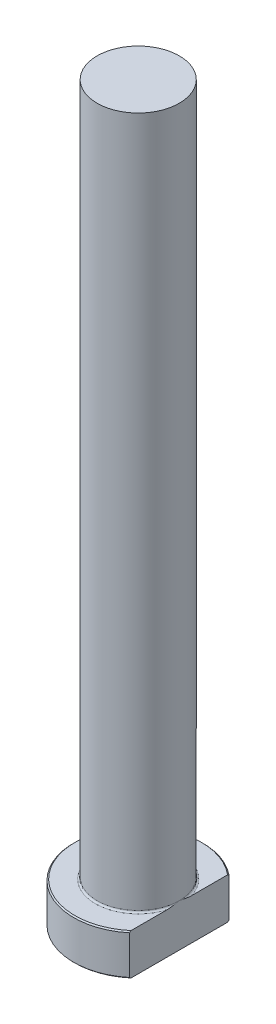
ISO-10303-21;
HEADER;
FILE_DESCRIPTION(('STEP AP214'),'2;1');
FILE_NAME('part.step','',(''),(''),'','','');
FILE_SCHEMA(('AUTOMOTIVE_DESIGN { 1 0 10303 214 1 1 1 1 }'));
ENDSEC;
DATA;
#1=APPLICATION_CONTEXT('core data for automotive mechanical design processes');
#2=APPLICATION_PROTOCOL_DEFINITION('international standard','automotive_design',2000,#1);
#3=PRODUCT_CONTEXT('',#1,'mechanical');
#4=PRODUCT('Part','Part','',(#3));
#5=PRODUCT_RELATED_PRODUCT_CATEGORY('part','',(#4));
#6=PRODUCT_DEFINITION_FORMATION('','',#4);
#7=PRODUCT_DEFINITION_CONTEXT('part definition',#1,'design');
#8=PRODUCT_DEFINITION('design','',#6,#7);
#9=PRODUCT_DEFINITION_SHAPE('','',#8);
#10=(LENGTH_UNIT() NAMED_UNIT(*) SI_UNIT(.MILLI.,.METRE.));
#11=(NAMED_UNIT(*) PLANE_ANGLE_UNIT() SI_UNIT($,.RADIAN.));
#12=(NAMED_UNIT(*) SI_UNIT($,.STERADIAN.) SOLID_ANGLE_UNIT());
#13=UNCERTAINTY_MEASURE_WITH_UNIT(LENGTH_MEASURE(1.E-05),#10,'distance_accuracy_value','');
#14=(GEOMETRIC_REPRESENTATION_CONTEXT(3) GLOBAL_UNCERTAINTY_ASSIGNED_CONTEXT((#13)) GLOBAL_UNIT_ASSIGNED_CONTEXT((#10,
#11,#12)) REPRESENTATION_CONTEXT('',''));
#15=CARTESIAN_POINT('',(0.,0.,0.));
#16=DIRECTION('',(0.,0.,1.));
#17=DIRECTION('',(1.,0.,0.));
#18=AXIS2_PLACEMENT_3D('',#15,#16,#17);
#19=CARTESIAN_POINT('',(0.,0.,0.));
#20=DIRECTION('',(0.,-1.,0.));
#21=DIRECTION('',(0.,0.,-1.));
#22=AXIS2_PLACEMENT_3D('',#19,#20,#21);
#23=PLANE('',#22);
#24=CARTESIAN_POINT('',(0.,0.,0.));
#25=DIRECTION('',(0.,-1.,0.));
#26=DIRECTION('',(0.,0.,-1.));
#27=AXIS2_PLACEMENT_3D('',#24,#25,#26);
#28=CIRCLE('',#27,10.8);
#29=CARTESIAN_POINT('',(6.99999999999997,0.,8.22435407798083));
#30=VERTEX_POINT('',#29);
#31=CARTESIAN_POINT('',(6.99999999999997,0.,-8.22435407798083));
#32=VERTEX_POINT('',#31);
#33=EDGE_CURVE('E98',#30,#32,#28,.T.);
#34=ORIENTED_EDGE('',*,*,#33,.T.);
#35=DIRECTION('',(0.,0.,1.));
#36=VECTOR('',#35,1.);
#37=CARTESIAN_POINT('',(6.99999999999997,0.,-8.48528137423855));
#38=LINE('',#37,#36);
#39=EDGE_CURVE('E83',#32,#30,#38,.T.);
#40=ORIENTED_EDGE('',*,*,#39,.T.);
#41=EDGE_LOOP('',(#34,#40));
#42=FACE_BOUND('',#41,.T.);
#43=ADVANCED_FACE('F32',(#42),#23,.T.);
#44=CARTESIAN_POINT('',(0.,259.958771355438,0.));
#45=DIRECTION('',(0.,1.,0.));
#46=DIRECTION('',(0.,0.,1.));
#47=AXIS2_PLACEMENT_3D('',#44,#45,#46);
#48=CYLINDRICAL_SURFACE('',#47,11.);
#49=CARTESIAN_POINT('',(0.,6.80000000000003,0.));
#50=DIRECTION('',(0.,1.,0.));
#51=DIRECTION('',(0.,0.,1.));
#52=AXIS2_PLACEMENT_3D('',#49,#50,#51);
#53=CIRCLE('',#52,11.);
#54=CARTESIAN_POINT('',(6.99999999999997,6.80000000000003,8.48528137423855));
#55=VERTEX_POINT('',#54);
#56=CARTESIAN_POINT('',(6.99999999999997,6.80000000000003,-8.48528137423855));
#57=VERTEX_POINT('',#56);
#58=EDGE_CURVE('E104',#55,#57,#53,.F.);
#59=ORIENTED_EDGE('',*,*,#58,.T.);
#60=DIRECTION('',(0.,-1.,0.));
#61=VECTOR('',#60,1.);
#62=CARTESIAN_POINT('',(6.99999999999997,125.,-8.48528137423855));
#63=LINE('',#62,#61);
#64=CARTESIAN_POINT('',(6.99999999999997,0.199999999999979,-8.48528137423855));
#65=VERTEX_POINT('',#64);
#66=EDGE_CURVE('E183',#57,#65,#63,.T.);
#67=ORIENTED_EDGE('',*,*,#66,.T.);
#68=CARTESIAN_POINT('',(0.,0.199999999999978,0.));
#69=DIRECTION('',(0.,-1.,0.));
#70=DIRECTION('',(0.,0.,-1.));
#71=AXIS2_PLACEMENT_3D('',#68,#69,#70);
#72=CIRCLE('',#71,11.);
#73=CARTESIAN_POINT('',(6.99999999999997,0.199999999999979,8.48528137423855));
#74=VERTEX_POINT('',#73);
#75=EDGE_CURVE('E100',#65,#74,#72,.F.);
#76=ORIENTED_EDGE('',*,*,#75,.T.);
#77=DIRECTION('',(0.,-1.,0.));
#78=VECTOR('',#77,1.);
#79=CARTESIAN_POINT('',(6.99999999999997,125.,8.48528137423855));
#80=LINE('',#79,#78);
#81=EDGE_CURVE('E93',#55,#74,#80,.T.);
#82=ORIENTED_EDGE('',*,*,#81,.F.);
#83=EDGE_LOOP('',(#59,#67,#76,#82));
#84=FACE_BOUND('',#83,.T.);
#85=ADVANCED_FACE('F158',(#84),#48,.T.);
#86=CARTESIAN_POINT('',(-11.,7.,0.));
#87=DIRECTION('',(0.,1.,0.));
#88=DIRECTION('',(0.,0.,1.));
#89=AXIS2_PLACEMENT_3D('',#86,#87,#88);
#90=PLANE('',#89);
#91=CARTESIAN_POINT('',(0.,7.,0.));
#92=DIRECTION('',(0.,1.,0.));
#93=DIRECTION('',(0.,0.,1.));
#94=AXIS2_PLACEMENT_3D('',#91,#92,#93);
#95=CIRCLE('',#94,10.8);
#96=CARTESIAN_POINT('',(6.99999999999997,7.,-8.22435407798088));
#97=VERTEX_POINT('',#96);
#98=CARTESIAN_POINT('',(6.99999999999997,7.,8.22435407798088));
#99=VERTEX_POINT('',#98);
#100=EDGE_CURVE('E178',#97,#99,#95,.T.);
#101=ORIENTED_EDGE('',*,*,#100,.T.);
#102=DIRECTION('',(0.,0.,-1.));
#103=VECTOR('',#102,1.);
#104=CARTESIAN_POINT('',(6.99999999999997,7.,0.));
#105=LINE('',#104,#103);
#106=CARTESIAN_POINT('',(6.99999999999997,6.99999999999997,2.07123151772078));
#107=VERTEX_POINT('',#106);
#108=EDGE_CURVE('E57',#99,#107,#105,.T.);
#109=ORIENTED_EDGE('',*,*,#108,.T.);
#110=CARTESIAN_POINT('',(0.,7.,0.));
#111=DIRECTION('',(0.,1.,0.));
#112=DIRECTION('',(0.,0.,1.));
#113=AXIS2_PLACEMENT_3D('',#110,#111,#112);
#114=CIRCLE('',#113,7.29999999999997);
#115=CARTESIAN_POINT('',(6.99999999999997,6.99999999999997,-2.07123151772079));
#116=VERTEX_POINT('',#115);
#117=EDGE_CURVE('E107',#107,#116,#114,.F.);
#118=ORIENTED_EDGE('',*,*,#117,.T.);
#119=EDGE_CURVE('E136',#116,#97,#105,.T.);
#120=ORIENTED_EDGE('',*,*,#119,.T.);
#121=EDGE_LOOP('',(#101,#109,#118,#120));
#122=FACE_BOUND('',#121,.T.);
#123=ADVANCED_FACE('F147',(#122),#90,.T.);
#124=CARTESIAN_POINT('',(0.,7.00000000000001,0.));
#125=DIRECTION('',(0.,-1.,0.));
#126=DIRECTION('',(0.,0.,-1.));
#127=AXIS2_PLACEMENT_3D('',#124,#125,#126);
#128=CONICAL_SURFACE('',#127,10.8,0.785398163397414);
#129=ORIENTED_EDGE('',*,*,#58,.F.);
#130=CARTESIAN_POINT('',(6.99999999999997,-2.13774979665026,18.6685261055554));
#131=CARTESIAN_POINT('',(6.99999999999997,-1.86574872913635,18.3780244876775));
#132=CARTESIAN_POINT('',(6.99999999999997,-1.59415659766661,18.0871392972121));
#133=CARTESIAN_POINT('',(6.99999999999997,-1.05192877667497,17.5044755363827));
#134=CARTESIAN_POINT('',(6.99999999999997,-0.7812930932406,17.2126969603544));
#135=CARTESIAN_POINT('',(6.99999999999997,-0.241050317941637,16.628048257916));
#136=CARTESIAN_POINT('',(6.99999999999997,0.0285564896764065,16.3351778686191));
#137=CARTESIAN_POINT('',(6.99999999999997,0.566485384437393,15.7482616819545));
#138=CARTESIAN_POINT('',(6.99999999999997,0.834807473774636,15.4542158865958));
#139=CARTESIAN_POINT('',(6.99999999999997,1.64198377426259,14.5651645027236));
#140=CARTESIAN_POINT('',(6.99999999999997,2.17856420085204,13.9680841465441));
#141=CARTESIAN_POINT('',(6.99999999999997,2.97696333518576,13.06681441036));
#142=CARTESIAN_POINT('',(6.99999999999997,3.24199785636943,12.7654727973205));
#143=CARTESIAN_POINT('',(6.99999999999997,3.7694585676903,12.1605141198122));
#144=CARTESIAN_POINT('',(6.99999999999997,4.03188476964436,11.8568970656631));
#145=CARTESIAN_POINT('',(6.99999999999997,4.50733797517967,11.3009625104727));
#146=CARTESIAN_POINT('',(6.99999999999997,4.72088020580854,11.0490858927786));
#147=CARTESIAN_POINT('',(6.99999999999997,5.14538078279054,10.5431655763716));
#148=CARTESIAN_POINT('',(6.99999999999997,5.35633915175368,10.2891218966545));
#149=CARTESIAN_POINT('',(6.99999999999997,5.77522964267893,9.77836737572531));
#150=CARTESIAN_POINT('',(6.99999999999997,5.98316044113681,9.52165544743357));
#151=CARTESIAN_POINT('',(6.99999999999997,6.39521098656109,9.0051908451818));
#152=CARTESIAN_POINT('',(6.99999999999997,6.59933078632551,8.74543821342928));
#153=CARTESIAN_POINT('',(6.99999999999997,7.00243445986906,8.222836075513));
#154=CARTESIAN_POINT('',(6.99999999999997,7.20142819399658,7.95999419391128));
#155=CARTESIAN_POINT('',(6.99999999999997,7.59353840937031,7.42991856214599));
#156=CARTESIAN_POINT('',(6.99999999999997,7.78665447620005,7.1626845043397));
#157=CARTESIAN_POINT('',(6.99999999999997,8.16523718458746,6.62311113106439));
#158=CARTESIAN_POINT('',(6.99999999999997,8.35070911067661,6.35077553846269));
#159=CARTESIAN_POINT('',(6.99999999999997,8.71189725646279,5.79973731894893));
#160=CARTESIAN_POINT('',(6.99999999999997,8.88761537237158,5.52103594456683));
#161=CARTESIAN_POINT('',(6.99999999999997,9.19554959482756,5.0070792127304));
#162=CARTESIAN_POINT('',(6.99999999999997,9.32988075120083,4.77309669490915));
#163=CARTESIAN_POINT('',(6.99999999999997,9.58764253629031,4.29911523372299));
#164=CARTESIAN_POINT('',(6.99999999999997,9.71107181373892,4.05911554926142));
#165=CARTESIAN_POINT('',(6.99999999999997,9.94390907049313,3.57263619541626));
#166=CARTESIAN_POINT('',(6.99999999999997,10.0533307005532,3.32616312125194));
#167=CARTESIAN_POINT('',(6.99999999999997,10.2545146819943,2.82607166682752));
#168=CARTESIAN_POINT('',(6.99999999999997,10.3462820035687,2.57245532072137));
#169=CARTESIAN_POINT('',(6.99999999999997,10.4907049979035,2.11254447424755));
#170=CARTESIAN_POINT('',(6.99999999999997,10.5475277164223,1.90756611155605));
#171=CARTESIAN_POINT('',(6.99999999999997,10.6452043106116,1.49381161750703));
#172=CARTESIAN_POINT('',(6.99999999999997,10.6860603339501,1.28503600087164));
#173=CARTESIAN_POINT('',(6.99999999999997,10.749755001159,0.865342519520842));
#174=CARTESIAN_POINT('',(6.99999999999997,10.7726462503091,0.65443275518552));
#175=CARTESIAN_POINT('',(6.99999999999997,10.7993569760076,0.231396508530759));
#176=CARTESIAN_POINT('',(6.99999999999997,10.8031771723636,0.0192700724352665));
#177=CARTESIAN_POINT('',(6.99999999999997,10.7915178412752,-0.404715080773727));
#178=CARTESIAN_POINT('',(6.99999999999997,10.7760135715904,-0.616573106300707));
#179=CARTESIAN_POINT('',(6.99999999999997,10.7265413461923,-1.03810446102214));
#180=CARTESIAN_POINT('',(6.99999999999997,10.6925718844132,-1.24777761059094));
#181=CARTESIAN_POINT('',(6.99999999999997,10.6077703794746,-1.66430273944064));
#182=CARTESIAN_POINT('',(6.99999999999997,10.5568873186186,-1.87114418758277));
#183=CARTESIAN_POINT('',(6.99999999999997,10.4404729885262,-2.28061279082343));
#184=CARTESIAN_POINT('',(6.99999999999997,10.3749414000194,-2.48323985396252));
#185=CARTESIAN_POINT('',(6.99999999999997,10.2190980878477,-2.9186026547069));
#186=CARTESIAN_POINT('',(6.99999999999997,10.1264616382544,-3.15050038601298));
#187=CARTESIAN_POINT('',(6.99999999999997,9.92740958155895,-3.60835455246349));
#188=CARTESIAN_POINT('',(6.99999999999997,9.82098769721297,-3.8343082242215));
#189=CARTESIAN_POINT('',(6.99999999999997,9.59695142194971,-4.28105341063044));
#190=CARTESIAN_POINT('',(6.99999999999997,9.47931762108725,-4.50183511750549));
#191=CARTESIAN_POINT('',(6.99999999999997,9.23524231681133,-4.93840249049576));
#192=CARTESIAN_POINT('',(6.99999999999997,9.10880204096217,-5.15418884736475));
#193=CARTESIAN_POINT('',(6.99999999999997,8.84714657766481,-5.58417945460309));
#194=CARTESIAN_POINT('',(6.99999999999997,8.71183920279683,-5.79832734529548));
#195=CARTESIAN_POINT('',(6.99999999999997,8.43533082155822,-6.2227763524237));
#196=CARTESIAN_POINT('',(6.99999999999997,8.29412966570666,-6.4330773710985));
#197=CARTESIAN_POINT('',(6.99999999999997,8.00706556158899,-6.85014007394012));
#198=CARTESIAN_POINT('',(6.99999999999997,7.8612076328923,-7.05690522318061));
#199=CARTESIAN_POINT('',(6.99999999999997,7.56553131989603,-7.46757278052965));
#200=CARTESIAN_POINT('',(6.99999999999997,7.41571298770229,-7.67147522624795));
#201=CARTESIAN_POINT('',(6.99999999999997,7.07999705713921,-8.12067189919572));
#202=CARTESIAN_POINT('',(6.99999999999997,6.89330819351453,-8.36537403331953));
#203=CARTESIAN_POINT('',(6.99999999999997,6.51597189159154,-8.85171196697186));
#204=CARTESIAN_POINT('',(6.99999999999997,6.32532432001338,-9.0933476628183));
#205=CARTESIAN_POINT('',(6.99999999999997,5.94076020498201,-9.5740466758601));
#206=CARTESIAN_POINT('',(6.99999999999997,5.74684327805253,-9.81310968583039));
#207=CARTESIAN_POINT('',(6.99999999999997,5.35630729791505,-10.2890203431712));
#208=CARTESIAN_POINT('',(6.99999999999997,5.1596882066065,-10.5258679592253));
#209=CARTESIAN_POINT('',(6.99999999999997,4.56606953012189,-11.2340330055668));
#210=CARTESIAN_POINT('',(6.99999999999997,4.16568148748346,-11.7025100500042));
#211=CARTESIAN_POINT('',(6.99999999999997,3.35840033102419,-12.6338245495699));
#212=CARTESIAN_POINT('',(6.99999999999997,2.95150704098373,-13.0966618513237));
#213=CARTESIAN_POINT('',(6.99999999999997,2.35017562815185,-13.7734103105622));
#214=CARTESIAN_POINT('',(6.99999999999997,2.15763812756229,-13.9890143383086));
#215=CARTESIAN_POINT('',(6.99999999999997,1.77161609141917,-14.4193671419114));
#216=CARTESIAN_POINT('',(6.99999999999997,1.57813157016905,-14.6341159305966));
#217=CARTESIAN_POINT('',(6.99999999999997,0.996412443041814,-15.2772388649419));
#218=CARTESIAN_POINT('',(6.99999999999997,0.606922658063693,-15.704477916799));
#219=CARTESIAN_POINT('',(6.99999999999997,-0.173895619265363,-16.5556520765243));
#220=CARTESIAN_POINT('',(6.99999999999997,-0.565218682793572,-16.9795921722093));
#221=CARTESIAN_POINT('',(6.99999999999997,-1.34999931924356,-17.8254589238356));
#222=CARTESIAN_POINT('',(6.99999999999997,-1.74345679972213,-18.2473856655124));
#223=CARTESIAN_POINT('',(6.99999999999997,-2.13774979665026,-18.6685261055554));
#224=B_SPLINE_CURVE_WITH_KNOTS('',3,(#130,#131,#132,#133,#134,#135,#136,#137,#138,#139,#140,
#141,#142,#143,#144,#145,#146,#147,#148,#149,#150,#151,#152,#153,#154,#155,#156,#157,#158,#159,
#160,#161,#162,#163,#164,#165,#166,#167,#168,#169,#170,#171,#172,#173,#174,#175,#176,#177,#178,
#179,#180,#181,#182,#183,#184,#185,#186,#187,#188,#189,#190,#191,#192,#193,#194,#195,#196,#197,
#198,#199,#200,#201,#202,#203,#204,#205,#206,#207,#208,#209,#210,#211,#212,#213,#214,#215,#216,
#217,#218,#219,#220,#221,#222,#223),.UNSPECIFIED.,.F.,.F.,(4,2,2,2,2,2,2,2,2,2,2,2,2,2,2,2,2,2,
2,2,2,2,2,2,2,2,2,2,2,2,2,2,2,2,2,2,2,2,2,2,2,2,2,2,2,2,4),(0.,1.19389386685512,
2.38779531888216,3.58200567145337,4.77621398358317,7.18442154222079,8.38834194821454,
9.59225689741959,10.5828886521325,11.5735117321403,12.5645555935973,13.5555857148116,
14.5445404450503,15.5335647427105,16.5218934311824,17.5100293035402,18.3192088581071,
19.1284885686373,19.93697351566,20.7452305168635,21.382812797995,22.0203092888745,
22.6559319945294,23.2915307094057,23.9279440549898,24.5644093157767,25.2028120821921,
25.8412287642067,26.589809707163,27.3387327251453,28.0889766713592,28.8391162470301,
29.5989369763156,30.3587769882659,31.1178239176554,31.8768608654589,32.8001653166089,
33.7235009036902,34.6469455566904,35.5704032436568,37.4191008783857,39.2678486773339,
40.1350269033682,41.0021920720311,42.7365692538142,44.4673795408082,46.1981154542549),.UNSPECIFIED.);
#225=EDGE_CURVE('E135',#55,#99,#224,.T.);
#226=ORIENTED_EDGE('',*,*,#225,.T.);
#227=ORIENTED_EDGE('',*,*,#100,.F.);
#228=EDGE_CURVE('E127',#97,#57,#224,.T.);
#229=ORIENTED_EDGE('',*,*,#228,.T.);
#230=EDGE_LOOP('',(#129,#226,#227,#229));
#231=FACE_BOUND('',#230,.T.);
#232=ADVANCED_FACE('F143',(#231),#128,.T.);
#233=CARTESIAN_POINT('',(0.,0.199999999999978,0.));
#234=DIRECTION('',(0.,1.,0.));
#235=DIRECTION('',(0.,0.,1.));
#236=AXIS2_PLACEMENT_3D('',#233,#234,#235);
#237=CONICAL_SURFACE('',#236,11.,0.785398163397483);
#238=ORIENTED_EDGE('',*,*,#75,.F.);
#239=CARTESIAN_POINT('',(6.99999999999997,9.13774979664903,-18.6685261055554));
#240=CARTESIAN_POINT('',(6.99999999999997,8.86574872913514,-18.3780244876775));
#241=CARTESIAN_POINT('',(6.99999999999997,8.59415659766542,-18.0871392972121));
#242=CARTESIAN_POINT('',(6.99999999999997,8.05192877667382,-17.5044755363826));
#243=CARTESIAN_POINT('',(6.99999999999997,7.78129309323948,-17.2126969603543));
#244=CARTESIAN_POINT('',(6.99999999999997,7.24105031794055,-16.6280482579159));
#245=CARTESIAN_POINT('',(6.99999999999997,6.97144351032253,-16.335177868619));
#246=CARTESIAN_POINT('',(6.99999999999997,6.43351461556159,-15.7482616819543));
#247=CARTESIAN_POINT('',(6.99999999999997,6.16519252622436,-15.4542158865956));
#248=CARTESIAN_POINT('',(6.99999999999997,5.35801622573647,-14.5651645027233));
#249=CARTESIAN_POINT('',(6.99999999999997,4.82143579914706,-13.9680841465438));
#250=CARTESIAN_POINT('',(6.99999999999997,4.0230366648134,-13.0668144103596));
#251=CARTESIAN_POINT('',(6.99999999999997,3.75800214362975,-12.7654727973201));
#252=CARTESIAN_POINT('',(6.99999999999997,3.23054143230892,-12.1605141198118));
#253=CARTESIAN_POINT('',(6.99999999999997,2.96811523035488,-11.8568970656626));
#254=CARTESIAN_POINT('',(6.99999999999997,2.49266202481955,-11.3009625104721));
#255=CARTESIAN_POINT('',(6.99999999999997,2.27911979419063,-11.0490858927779));
#256=CARTESIAN_POINT('',(6.99999999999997,1.85461921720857,-10.5431655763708));
#257=CARTESIAN_POINT('',(6.99999999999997,1.64366084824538,-10.2891218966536));
#258=CARTESIAN_POINT('',(6.99999999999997,1.22477035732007,-9.77836737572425));
#259=CARTESIAN_POINT('',(6.99999999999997,1.01683955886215,-9.52165544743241));
#260=CARTESIAN_POINT('',(6.99999999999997,0.60478901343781,-9.00519084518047));
#261=CARTESIAN_POINT('',(6.99999999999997,0.400669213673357,-8.74543821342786));
#262=CARTESIAN_POINT('',(6.99999999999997,-0.00243445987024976,-8.2228360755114));
#263=CARTESIAN_POINT('',(6.99999999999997,-0.201428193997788,-7.9599941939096));
#264=CARTESIAN_POINT('',(6.99999999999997,-0.593538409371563,-7.42991856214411));
#265=CARTESIAN_POINT('',(6.99999999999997,-0.786654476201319,-7.16268450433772));
#266=CARTESIAN_POINT('',(6.99999999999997,-1.16523718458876,-6.62311113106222));
#267=CARTESIAN_POINT('',(6.99999999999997,-1.35070911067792,-6.35077553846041));
#268=CARTESIAN_POINT('',(6.99999999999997,-1.7118972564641,-5.79973731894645));
#269=CARTESIAN_POINT('',(6.99999999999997,-1.88761537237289,-5.52103594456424));
#270=CARTESIAN_POINT('',(6.99999999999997,-2.19554959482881,-5.00707921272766));
#271=CARTESIAN_POINT('',(6.99999999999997,-2.32988075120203,-4.77309669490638));
#272=CARTESIAN_POINT('',(6.99999999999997,-2.58764253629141,-4.29911523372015));
#273=CARTESIAN_POINT('',(6.99999999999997,-2.71107181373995,-4.05911554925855));
#274=CARTESIAN_POINT('',(6.99999999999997,-2.94390907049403,-3.57263619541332));
#275=CARTESIAN_POINT('',(6.99999999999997,-3.05333070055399,-3.32616312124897));
#276=CARTESIAN_POINT('',(6.99999999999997,-3.25451468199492,-2.82607166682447));
#277=CARTESIAN_POINT('',(6.99999999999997,-3.34628200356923,-2.57245532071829));
#278=CARTESIAN_POINT('',(6.99999999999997,-3.49070499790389,-2.11254447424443));
#279=CARTESIAN_POINT('',(6.99999999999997,-3.54752771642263,-1.90756611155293));
#280=CARTESIAN_POINT('',(6.99999999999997,-3.64520431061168,-1.49381161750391));
#281=CARTESIAN_POINT('',(6.99999999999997,-3.68606033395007,-1.28503600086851));
#282=CARTESIAN_POINT('',(6.99999999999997,-3.74975500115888,-0.865342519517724));
#283=CARTESIAN_POINT('',(6.99999999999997,-3.7726462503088,-0.65443275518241));
#284=CARTESIAN_POINT('',(6.99999999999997,-3.79935697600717,-0.231396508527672));
#285=CARTESIAN_POINT('',(6.99999999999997,-3.80317717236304,-0.019270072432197));
#286=CARTESIAN_POINT('',(6.99999999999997,-3.79151784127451,0.404715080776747));
#287=CARTESIAN_POINT('',(6.99999999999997,-3.77601357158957,0.616573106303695));
#288=CARTESIAN_POINT('',(6.99999999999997,-3.72654134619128,1.03810446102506));
#289=CARTESIAN_POINT('',(6.99999999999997,-3.69257188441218,1.24777761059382));
#290=CARTESIAN_POINT('',(6.99999999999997,-3.60777037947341,1.66430273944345));
#291=CARTESIAN_POINT('',(6.99999999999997,-3.55688731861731,1.87114418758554));
#292=CARTESIAN_POINT('',(6.99999999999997,-3.44047298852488,2.28061279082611));
#293=CARTESIAN_POINT('',(6.99999999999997,-3.37494140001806,2.48323985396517));
#294=CARTESIAN_POINT('',(6.99999999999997,-3.21909808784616,2.91860265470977));
#295=CARTESIAN_POINT('',(6.99999999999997,-3.12646163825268,3.15050038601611));
#296=CARTESIAN_POINT('',(6.99999999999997,-2.92740958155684,3.60835455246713));
#297=CARTESIAN_POINT('',(6.99999999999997,-2.82098769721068,3.8343082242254));
#298=CARTESIAN_POINT('',(6.99999999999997,-2.59695142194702,4.28105341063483));
#299=CARTESIAN_POINT('',(6.99999999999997,-2.47931762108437,4.50183511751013));
#300=CARTESIAN_POINT('',(6.99999999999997,-2.23524231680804,4.93840249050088));
#301=CARTESIAN_POINT('',(6.99999999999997,-2.10880204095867,5.1541888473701));
#302=CARTESIAN_POINT('',(6.99999999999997,-1.84714657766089,5.58417945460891));
#303=CARTESIAN_POINT('',(6.99999999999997,-1.71183920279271,5.79832734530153));
#304=CARTESIAN_POINT('',(6.99999999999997,-1.43533082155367,6.2227763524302));
#305=CARTESIAN_POINT('',(6.99999999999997,-1.29412966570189,6.43307737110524));
#306=CARTESIAN_POINT('',(6.99999999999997,-1.00706556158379,6.85014007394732));
#307=CARTESIAN_POINT('',(6.99999999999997,-0.861207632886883,7.05690522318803));
#308=CARTESIAN_POINT('',(6.99999999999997,-0.565531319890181,7.46757278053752));
#309=CARTESIAN_POINT('',(6.99999999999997,-0.415712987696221,7.67147522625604));
#310=CARTESIAN_POINT('',(6.99999999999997,-0.0799970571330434,8.12067189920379));
#311=CARTESIAN_POINT('',(6.99999999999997,0.106691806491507,8.36537403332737));
#312=CARTESIAN_POINT('',(6.99999999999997,0.484028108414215,8.85171196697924));
#313=CARTESIAN_POINT('',(6.99999999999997,0.674675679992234,9.09334766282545));
#314=CARTESIAN_POINT('',(6.99999999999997,1.05923979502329,9.57404667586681));
#315=CARTESIAN_POINT('',(6.99999999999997,1.25315672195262,9.81310968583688));
#316=CARTESIAN_POINT('',(6.99999999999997,1.64369270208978,10.2890203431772));
#317=CARTESIAN_POINT('',(6.99999999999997,1.84031179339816,10.5258679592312));
#318=CARTESIAN_POINT('',(6.99999999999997,2.43393046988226,11.2340330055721));
#319=CARTESIAN_POINT('',(6.99999999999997,2.83431851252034,11.702510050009));
#320=CARTESIAN_POINT('',(6.99999999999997,3.64159966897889,12.633824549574));
#321=CARTESIAN_POINT('',(6.99999999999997,4.04849295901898,13.0966618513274));
#322=CARTESIAN_POINT('',(6.99999999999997,4.64982437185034,13.7734103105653));
#323=CARTESIAN_POINT('',(6.99999999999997,4.84236187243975,13.9890143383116));
#324=CARTESIAN_POINT('',(6.99999999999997,5.22838390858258,14.4193671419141));
#325=CARTESIAN_POINT('',(6.99999999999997,5.42186842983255,14.6341159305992));
#326=CARTESIAN_POINT('',(6.99999999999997,6.00358755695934,15.2772388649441));
#327=CARTESIAN_POINT('',(6.99999999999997,6.39307734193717,15.7044779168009));
#328=CARTESIAN_POINT('',(6.99999999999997,7.17389561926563,16.5556520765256));
#329=CARTESIAN_POINT('',(6.99999999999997,7.56521868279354,16.9795921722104));
#330=CARTESIAN_POINT('',(6.99999999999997,8.34999931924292,17.8254589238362));
#331=CARTESIAN_POINT('',(6.99999999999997,8.7434567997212,18.2473856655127));
#332=CARTESIAN_POINT('',(6.99999999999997,9.13774979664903,18.6685261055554));
#333=B_SPLINE_CURVE_WITH_KNOTS('',3,(#239,#240,#241,#242,#243,#244,#245,#246,#247,#248,#249,
#250,#251,#252,#253,#254,#255,#256,#257,#258,#259,#260,#261,#262,#263,#264,#265,#266,#267,#268,
#269,#270,#271,#272,#273,#274,#275,#276,#277,#278,#279,#280,#281,#282,#283,#284,#285,#286,#287,
#288,#289,#290,#291,#292,#293,#294,#295,#296,#297,#298,#299,#300,#301,#302,#303,#304,#305,#306,
#307,#308,#309,#310,#311,#312,#313,#314,#315,#316,#317,#318,#319,#320,#321,#322,#323,#324,#325,
#326,#327,#328,#329,#330,#331,#332),.UNSPECIFIED.,.F.,.F.,(4,2,2,2,2,2,2,2,2,2,2,2,2,2,2,2,2,2,
2,2,2,2,2,2,2,2,2,2,2,2,2,2,2,2,2,2,2,2,2,2,2,2,2,2,2,2,4),(0.,1.19389386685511,
2.38779531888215,3.58200567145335,4.77621398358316,7.18442154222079,8.38834194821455,
9.59225689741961,10.5828886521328,11.5735117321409,12.5645555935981,13.5555857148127,
14.5445404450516,15.5335647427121,16.5218934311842,17.5100293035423,18.3192088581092,
19.1284885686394,19.9369735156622,20.7452305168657,21.3828127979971,22.0203092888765,
22.6559319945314,23.2915307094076,23.9279440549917,24.5644093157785,25.2028120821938,
25.8412287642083,26.5898097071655,27.3387327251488,28.0889766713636,28.8391162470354,
29.5989369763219,30.3587769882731,31.1178239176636,31.8768608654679,32.8001653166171,
33.7235009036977,34.6469455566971,35.5704032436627,37.41910087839,39.2678486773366,
40.1350269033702,41.0021920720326,42.7365692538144,44.4673795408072,46.1981154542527),.UNSPECIFIED.);
#334=EDGE_CURVE('E86',#65,#32,#333,.T.);
#335=ORIENTED_EDGE('',*,*,#334,.T.);
#336=ORIENTED_EDGE('',*,*,#33,.F.);
#337=EDGE_CURVE('E89',#30,#74,#333,.T.);
#338=ORIENTED_EDGE('',*,*,#337,.T.);
#339=EDGE_LOOP('',(#238,#335,#336,#338));
#340=FACE_BOUND('',#339,.T.);
#341=ADVANCED_FACE('F97',(#340),#237,.T.);
#342=CARTESIAN_POINT('',(0.,7.29999999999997,0.));
#343=DIRECTION('',(0.,1.,0.));
#344=DIRECTION('',(0.,0.,1.));
#345=AXIS2_PLACEMENT_3D('',#342,#343,#344);
#346=TOROIDAL_SURFACE('',#345,7.29999999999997,0.3);
#347=CARTESIAN_POINT('',(6.99999999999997,7.29999999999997,0.));
#348=CARTESIAN_POINT('',(6.99999999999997,7.30000062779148,2.32628005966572E-11));
#349=CARTESIAN_POINT('',(6.99999999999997,7.30000125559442,-3.16909134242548E-07));
#350=CARTESIAN_POINT('',(6.99999999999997,7.30000241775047,-1.14637029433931E-06));
#351=CARTESIAN_POINT('',(6.99999999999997,7.30000292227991,-1.68168827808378E-06));
#352=CARTESIAN_POINT('',(6.99999999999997,7.30000400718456,-2.97869768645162E-06));
#353=CARTESIAN_POINT('',(6.99999999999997,7.30000456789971,-3.76131367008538E-06));
#354=CARTESIAN_POINT('',(6.99999999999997,7.30000553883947,-5.35167977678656E-06));
#355=CARTESIAN_POINT('',(6.99999999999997,7.30000595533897,-6.15604635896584E-06));
#356=CARTESIAN_POINT('',(6.99999999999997,7.30000758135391,-9.388029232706E-06));
#357=CARTESIAN_POINT('',(6.99999999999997,7.30000871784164,-1.18573464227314E-05));
#358=CARTESIAN_POINT('',(6.99999999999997,7.30001050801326,-1.66549715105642E-05));
#359=CARTESIAN_POINT('',(6.99999999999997,7.30001120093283,-1.89691200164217E-05));
#360=CARTESIAN_POINT('',(6.99999999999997,7.30001423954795,-2.9073526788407E-05));
#361=CARTESIAN_POINT('',(6.99999999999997,7.30001661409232,-3.68567169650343E-05));
#362=CARTESIAN_POINT('',(6.99999999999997,7.30001997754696,-5.13387672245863E-05));
#363=CARTESIAN_POINT('',(6.99999999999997,7.30002113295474,-5.79981986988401E-05));
#364=CARTESIAN_POINT('',(6.99999999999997,7.30002974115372,-0.000108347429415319));
#365=CARTESIAN_POINT('',(6.99999999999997,7.30003649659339,-0.000152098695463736));
#366=CARTESIAN_POINT('',(6.99999999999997,7.30006604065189,-0.000326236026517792));
#367=CARTESIAN_POINT('',(6.99999999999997,7.30009398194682,-0.000455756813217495));
#368=CARTESIAN_POINT('',(6.99999999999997,7.30020370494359,-0.000971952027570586));
#369=CARTESIAN_POINT('',(6.99999999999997,7.30028233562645,-0.00135905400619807));
#370=CARTESIAN_POINT('',(6.99999999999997,7.30059908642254,-0.00290811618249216));
#371=CARTESIAN_POINT('',(6.99999999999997,7.30084128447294,-0.00406949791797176));
#372=CARTESIAN_POINT('',(6.99999999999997,7.30185637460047,-0.00894870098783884));
#373=CARTESIAN_POINT('',(6.99999999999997,7.30262406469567,-0.0126672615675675));
#374=CARTESIAN_POINT('',(6.99999999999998,7.30904362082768,-0.0437472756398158));
#375=CARTESIAN_POINT('',(6.99999999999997,7.31471492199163,-0.0711060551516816));
#376=CARTESIAN_POINT('',(6.99999999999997,7.3257989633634,-0.124711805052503));
#377=CARTESIAN_POINT('',(6.99999999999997,7.33121280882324,-0.150958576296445));
#378=CARTESIAN_POINT('',(6.99999999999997,7.34888721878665,-0.236855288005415));
#379=CARTESIAN_POINT('',(6.99999999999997,7.36109504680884,-0.296516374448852));
#380=CARTESIAN_POINT('',(6.99999999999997,7.38163193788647,-0.398125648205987));
#381=CARTESIAN_POINT('',(6.99999999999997,7.39003371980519,-0.440059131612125));
#382=CARTESIAN_POINT('',(6.99999999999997,7.40641913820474,-0.522820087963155));
#383=CARTESIAN_POINT('',(6.99999999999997,7.41440792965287,-0.563646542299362));
#384=CARTESIAN_POINT('',(6.99999999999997,7.44025584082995,-0.697745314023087));
#385=CARTESIAN_POINT('',(6.99999999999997,7.45763052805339,-0.791112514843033));
#386=CARTESIAN_POINT('',(6.99999999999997,7.4907040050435,-0.979068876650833));
#387=CARTESIAN_POINT('',(6.99999999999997,7.50638514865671,-1.07366117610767));
#388=CARTESIAN_POINT('',(6.99999999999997,7.53649600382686,-1.27237182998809));
#389=CARTESIAN_POINT('',(6.99999999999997,7.55066037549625,-1.37653153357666));
#390=CARTESIAN_POINT('',(6.99999999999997,7.57450660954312,-1.58508707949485));
#391=CARTESIAN_POINT('',(6.99999999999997,7.58420070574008,-1.68948148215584));
#392=CARTESIAN_POINT('',(6.99999999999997,7.5971656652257,-1.89515538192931));
#393=CARTESIAN_POINT('',(6.99999999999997,7.60064432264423,-1.9964196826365));
#394=CARTESIAN_POINT('',(6.99999999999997,7.59954163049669,-2.14745317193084));
#395=CARTESIAN_POINT('',(6.99999999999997,7.59815772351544,-2.19724153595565));
#396=CARTESIAN_POINT('',(6.99999999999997,7.59283451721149,-2.29666246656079));
#397=CARTESIAN_POINT('',(6.99999999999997,7.58889656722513,-2.34629510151));
#398=CARTESIAN_POINT('',(6.99999999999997,7.57769755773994,-2.44571674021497));
#399=CARTESIAN_POINT('',(6.99999999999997,7.57040396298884,-2.49550242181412));
#400=CARTESIAN_POINT('',(6.99999999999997,7.5560244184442,-2.56951537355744));
#401=CARTESIAN_POINT('',(6.99999999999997,7.55065780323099,-2.59407625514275));
#402=CARTESIAN_POINT('',(6.99999999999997,7.53852479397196,-2.642845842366));
#403=CARTESIAN_POINT('',(6.99999999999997,7.53175908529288,-2.66705471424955));
#404=CARTESIAN_POINT('',(6.99999999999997,7.5174892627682,-2.71174649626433));
#405=CARTESIAN_POINT('',(6.99999999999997,7.510201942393,-2.73229789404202));
#406=CARTESIAN_POINT('',(6.99999999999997,7.4939308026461,-2.77282387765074));
#407=CARTESIAN_POINT('',(6.99999999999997,7.4849410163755,-2.79279614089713));
#408=CARTESIAN_POINT('',(6.99999999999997,7.46462265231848,-2.83190553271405));
#409=CARTESIAN_POINT('',(6.99999999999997,7.45326134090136,-2.85102586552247));
#410=CARTESIAN_POINT('',(6.99999999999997,7.4274542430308,-2.88704231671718));
#411=CARTESIAN_POINT('',(6.99999999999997,7.41303489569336,-2.90395561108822));
#412=CARTESIAN_POINT('',(6.99999999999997,7.39049681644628,-2.92384155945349));
#413=CARTESIAN_POINT('',(6.99999999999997,7.3841904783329,-2.92884725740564));
#414=CARTESIAN_POINT('',(6.99999999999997,7.3709718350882,-2.9380049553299));
#415=CARTESIAN_POINT('',(6.99999999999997,7.36405938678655,-2.94215675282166));
#416=CARTESIAN_POINT('',(6.99999999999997,7.34956926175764,-2.94936604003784));
#417=CARTESIAN_POINT('',(6.99999999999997,7.34198467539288,-2.95240998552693));
#418=CARTESIAN_POINT('',(6.99999999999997,7.32637763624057,-2.95700924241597));
#419=CARTESIAN_POINT('',(6.99999999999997,7.31835605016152,-2.95856739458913));
#420=CARTESIAN_POINT('',(6.99999999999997,7.3029104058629,-2.95992508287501));
#421=CARTESIAN_POINT('',(6.99999999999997,7.29549953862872,-2.95987367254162));
#422=CARTESIAN_POINT('',(6.99999999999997,7.28081803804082,-2.95838504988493));
#423=CARTESIAN_POINT('',(6.99999999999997,7.27354749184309,-2.95694700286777));
#424=CARTESIAN_POINT('',(6.99999999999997,7.25853285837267,-2.95260391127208));
#425=CARTESIAN_POINT('',(6.99999999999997,7.25083383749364,-2.94954604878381));
#426=CARTESIAN_POINT('',(6.99999999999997,7.23603628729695,-2.9422241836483));
#427=CARTESIAN_POINT('',(6.99999999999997,7.22893877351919,-2.93795819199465));
#428=CARTESIAN_POINT('',(6.99999999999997,7.21163875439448,-2.92593351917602));
#429=CARTESIAN_POINT('',(6.99999999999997,7.20187862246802,-2.91754511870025));
#430=CARTESIAN_POINT('',(6.99999999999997,7.18370674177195,-2.89942475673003));
#431=CARTESIAN_POINT('',(6.99999999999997,7.17529892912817,-2.88968902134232));
#432=CARTESIAN_POINT('',(6.99999999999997,7.15199560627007,-2.85953893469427));
#433=CARTESIAN_POINT('',(6.99999999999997,7.13869481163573,-2.83790736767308));
#434=CARTESIAN_POINT('',(6.99999999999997,7.11507068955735,-2.79314645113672));
#435=CARTESIAN_POINT('',(6.99999999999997,7.10475206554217,-2.77001480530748));
#436=CARTESIAN_POINT('',(6.99999999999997,7.08155610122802,-2.7108784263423));
#437=CARTESIAN_POINT('',(6.99999999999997,7.07006528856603,-2.67433519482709));
#438=CARTESIAN_POINT('',(6.99999999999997,7.05044959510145,-2.60033159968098));
#439=CARTESIAN_POINT('',(6.99999999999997,7.04233234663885,-2.5628693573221));
#440=CARTESIAN_POINT('',(6.99999999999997,7.02853576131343,-2.48688638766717));
#441=CARTESIAN_POINT('',(6.99999999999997,7.02289758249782,-2.4483583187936));
#442=CARTESIAN_POINT('',(6.99999999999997,7.01369461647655,-2.37112071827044));
#443=CARTESIAN_POINT('',(6.99999999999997,7.01012698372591,-2.33241150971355));
#444=CARTESIAN_POINT('',(6.99999999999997,7.00239886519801,-2.22280038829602));
#445=CARTESIAN_POINT('',(6.99999999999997,7.00019016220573,-2.15176184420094));
#446=CARTESIAN_POINT('',(6.99999999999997,6.99983406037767,-2.0096618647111));
#447=CARTESIAN_POINT('',(6.99999999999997,7.00168936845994,-1.9386004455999));
#448=CARTESIAN_POINT('',(6.99999999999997,7.00854815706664,-1.79630907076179));
#449=CARTESIAN_POINT('',(6.99999999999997,7.01356610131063,-1.7250798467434));
#450=CARTESIAN_POINT('',(6.99999999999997,7.02608998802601,-1.5828366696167));
#451=CARTESIAN_POINT('',(6.99999999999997,7.03359634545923,-1.51182275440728));
#452=CARTESIAN_POINT('',(6.99999999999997,7.0575822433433,-1.31152735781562));
#453=CARTESIAN_POINT('',(6.99999999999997,7.07635481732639,-1.18252326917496));
#454=CARTESIAN_POINT('',(6.99999999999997,7.11790553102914,-0.926646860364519));
#455=CARTESIAN_POINT('',(6.99999999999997,7.14063741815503,-0.799766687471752));
#456=CARTESIAN_POINT('',(6.99999999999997,7.17322033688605,-0.627620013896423));
#457=CARTESIAN_POINT('',(6.99999999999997,7.18199317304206,-0.582145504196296));
#458=CARTESIAN_POINT('',(6.99999999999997,7.20004716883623,-0.489938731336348));
#459=CARTESIAN_POINT('',(6.99999999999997,7.20933569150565,-0.443207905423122));
#460=CARTESIAN_POINT('',(6.99999999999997,7.22546843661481,-0.362914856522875));
#461=CARTESIAN_POINT('',(6.99999999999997,7.23226586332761,-0.329343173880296));
#462=CARTESIAN_POINT('',(6.99999999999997,7.24586025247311,-0.262588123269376));
#463=CARTESIAN_POINT('',(6.99999999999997,7.25265638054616,-0.22940458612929));
#464=CARTESIAN_POINT('',(6.99999999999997,7.26550614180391,-0.166874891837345));
#465=CARTESIAN_POINT('',(6.99999999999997,7.27155497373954,-0.137527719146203));
#466=CARTESIAN_POINT('',(6.99999999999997,7.28394498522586,-0.0775831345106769));
#467=CARTESIAN_POINT('',(6.99999999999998,7.29028759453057,-0.0469859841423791));
#468=CARTESIAN_POINT('',(6.99999999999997,7.29737625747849,-0.0126656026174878));
#469=CARTESIAN_POINT('',(6.99999999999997,7.29814430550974,-0.00894538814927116));
#470=CARTESIAN_POINT('',(6.99999999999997,7.29915947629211,-0.00406582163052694));
#471=CARTESIAN_POINT('',(6.99999999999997,7.29940140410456,-0.00290573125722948));
#472=CARTESIAN_POINT('',(6.99999999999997,7.29971782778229,-0.00135826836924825));
#473=CARTESIAN_POINT('',(6.99999999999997,7.29979639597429,-0.000971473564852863));
#474=CARTESIAN_POINT('',(6.99999999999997,7.29990604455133,-0.000455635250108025));
#475=CARTESIAN_POINT('',(6.99999999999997,7.2999339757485,-0.00032616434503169));
#476=CARTESIAN_POINT('',(6.99999999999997,7.29996351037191,-0.000152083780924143));
#477=CARTESIAN_POINT('',(6.99999999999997,7.29997026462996,-0.000108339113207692));
#478=CARTESIAN_POINT('',(6.99999999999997,7.29997887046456,-5.7996672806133E-05));
#479=CARTESIAN_POINT('',(6.99999999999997,7.29998002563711,-5.13375704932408E-05));
#480=CARTESIAN_POINT('',(6.99999999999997,7.29998338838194,-3.6856228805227E-05));
#481=CARTESIAN_POINT('',(6.99999999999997,7.29998576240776,-2.90734013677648E-05));
#482=CARTESIAN_POINT('',(6.99999999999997,7.29998880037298,-1.8969379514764E-05));
#483=CARTESIAN_POINT('',(6.99999999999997,7.29998949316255,-1.6655255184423E-05));
#484=CARTESIAN_POINT('',(6.99999999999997,7.29999128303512,-1.18576604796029E-05));
#485=CARTESIAN_POINT('',(6.99999999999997,7.29999241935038,-9.38834597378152E-06));
#486=CARTESIAN_POINT('',(6.99999999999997,7.29999404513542,-6.15634598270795E-06));
#487=CARTESIAN_POINT('',(6.99999999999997,7.29999446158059,-5.35196743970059E-06));
#488=CARTESIAN_POINT('',(6.99999999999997,7.29999543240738,-3.76156762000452E-06));
#489=CARTESIAN_POINT('',(6.99999999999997,7.29999599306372,-2.97892931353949E-06));
#490=CARTESIAN_POINT('',(6.99999999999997,7.29999707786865,-1.68186918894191E-06));
#491=CARTESIAN_POINT('',(6.99999999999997,7.29999758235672,-1.14652503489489E-06));
#492=CARTESIAN_POINT('',(6.99999999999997,7.2999987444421,-3.16995271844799E-07));
#493=CARTESIAN_POINT('',(6.99999999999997,7.29999937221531,-2.32625469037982E-11));
#494=CARTESIAN_POINT('',(6.99999999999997,7.29999999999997,0.));
#495=B_SPLINE_CURVE_WITH_KNOTS('',3,(#347,#348,#349,#350,#351,#352,#353,#354,#355,#356,#357,
#358,#359,#360,#361,#362,#363,#364,#365,#366,#367,#368,#369,#370,#371,#372,#373,#374,#375,#376,
#377,#378,#379,#380,#381,#382,#383,#384,#385,#386,#387,#388,#389,#390,#391,#392,#393,#394,#395,
#396,#397,#398,#399,#400,#401,#402,#403,#404,#405,#406,#407,#408,#409,#410,#411,#412,#413,#414,
#415,#416,#417,#418,#419,#420,#421,#422,#423,#424,#425,#426,#427,#428,#429,#430,#431,#432,#433,
#434,#435,#436,#437,#438,#439,#440,#441,#442,#443,#444,#445,#446,#447,#448,#449,#450,#451,#452,
#453,#454,#455,#456,#457,#458,#459,#460,#461,#462,#463,#464,#465,#466,#467,#468,#469,#470,#471,
#472,#473,#474,#475,#476,#477,#478,#479,#480,#481,#482,#483,#484,#485,#486,#487,#488,#489,#490,
#491,#492,#493,#494),.UNSPECIFIED.,.T.,.F.,(4,2,2,2,2,2,2,2,2,2,2,2,2,2,2,2,2,2,2,2,2,2,2,2,2,2,
2,2,2,2,2,2,2,2,2,2,2,2,2,2,2,2,2,2,2,2,2,2,2,2,2,2,2,2,2,2,2,2,2,2,2,2,2,2,2,2,2,2,2,2,2,2,2,
4),(0.,1.92694204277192E-06,4.154269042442E-06,7.01948468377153E-06,9.73677790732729E-06,
1.78669784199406E-05,2.510708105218E-05,4.94892168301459E-05,6.97447136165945E-05,
0.000202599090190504,0.000599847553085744,0.00178514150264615,0.00534391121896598,
0.0167352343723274,0.100554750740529,0.180953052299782,0.36364407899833,0.491944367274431,
0.616746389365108,0.901643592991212,1.18926961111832,1.50455392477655,1.81897020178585,
2.12266301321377,2.27203455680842,2.42132724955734,2.57209897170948,2.64748997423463,
2.72284413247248,2.7882086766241,2.85380670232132,2.92037838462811,2.98639639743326,
3.01049823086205,3.03460577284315,3.05899886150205,3.08334521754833,3.10544427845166,
3.12755665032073,3.15227309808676,3.17703047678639,3.21542082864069,3.25392097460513,
3.32967543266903,3.4055487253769,3.52018968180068,3.63508860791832,3.75182904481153,
3.86840866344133,4.08144496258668,4.29462320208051,4.5087835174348,4.72297956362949,
5.11393929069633,5.50060554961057,5.63954426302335,5.78247850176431,5.8852372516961,
5.98685401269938,6.07674665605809,6.17048759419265,6.18188399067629,6.18543880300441,
6.18662315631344,6.18702025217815,6.18715308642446,6.18717334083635,6.18719772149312,
6.18720496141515,6.18721309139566,6.1872158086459,6.18721867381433,6.18722090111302,
6.18722282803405),.UNSPECIFIED.);
#496=CARTESIAN_POINT('',(6.99999999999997,7.29999999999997,0.));
#497=VERTEX_POINT('',#496);
#498=EDGE_CURVE('E11',#116,#497,#495,.T.);
#499=ORIENTED_EDGE('',*,*,#498,.F.);
#500=ORIENTED_EDGE('',*,*,#117,.F.);
#501=CARTESIAN_POINT('',(6.99999999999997,7.29999999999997,0.));
#502=CARTESIAN_POINT('',(6.99999999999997,7.29999937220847,-2.32626743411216E-11));
#503=CARTESIAN_POINT('',(6.99999999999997,7.29999874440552,3.16909134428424E-07));
#504=CARTESIAN_POINT('',(6.99999999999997,7.29999758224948,1.14637029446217E-06));
#505=CARTESIAN_POINT('',(6.99999999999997,7.29999707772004,1.68168827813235E-06));
#506=CARTESIAN_POINT('',(6.99999999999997,7.29999599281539,2.97869768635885E-06));
#507=CARTESIAN_POINT('',(6.99999999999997,7.29999543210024,3.76131366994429E-06));
#508=CARTESIAN_POINT('',(6.99999999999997,7.29999446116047,5.35167977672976E-06));
#509=CARTESIAN_POINT('',(6.99999999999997,7.29999404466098,6.15604635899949E-06));
#510=CARTESIAN_POINT('',(6.99999999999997,7.29999241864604,9.38802923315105E-06));
#511=CARTESIAN_POINT('',(6.99999999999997,7.29999128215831,1.18573464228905E-05));
#512=CARTESIAN_POINT('',(6.99999999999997,7.29998949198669,1.66549715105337E-05));
#513=CARTESIAN_POINT('',(6.99999999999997,7.29998879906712,1.8969120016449E-05));
#514=CARTESIAN_POINT('',(6.99999999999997,7.29998576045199,2.90735267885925E-05));
#515=CARTESIAN_POINT('',(6.99999999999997,7.29998338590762,3.68567169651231E-05));
#516=CARTESIAN_POINT('',(6.99999999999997,7.29998002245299,5.13387672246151E-05));
#517=CARTESIAN_POINT('',(6.99999999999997,7.2999788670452,5.7998198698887E-05));
#518=CARTESIAN_POINT('',(6.99999999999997,7.29997025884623,0.00010834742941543));
#519=CARTESIAN_POINT('',(6.99999999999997,7.29996350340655,0.000152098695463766));
#520=CARTESIAN_POINT('',(6.99999999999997,7.29993395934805,0.000326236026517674));
#521=CARTESIAN_POINT('',(6.99999999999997,7.29990601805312,0.000455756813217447));
#522=CARTESIAN_POINT('',(6.99999999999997,7.29979629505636,0.0009719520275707));
#523=CARTESIAN_POINT('',(6.99999999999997,7.2997176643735,0.00135905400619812));
#524=CARTESIAN_POINT('',(6.99999999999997,7.29940091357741,0.00290811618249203));
#525=CARTESIAN_POINT('',(6.99999999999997,7.29915871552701,0.0040694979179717));
#526=CARTESIAN_POINT('',(6.99999999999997,7.29814362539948,0.00894870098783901));
#527=CARTESIAN_POINT('',(6.99999999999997,7.29737593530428,0.0126672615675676));
#528=CARTESIAN_POINT('',(6.99999999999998,7.29095637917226,0.0437472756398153));
#529=CARTESIAN_POINT('',(6.99999999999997,7.28528507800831,0.0711060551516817));
#530=CARTESIAN_POINT('',(6.99999999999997,7.27420103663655,0.124711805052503));
#531=CARTESIAN_POINT('',(6.99999999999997,7.2687871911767,0.150958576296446));
#532=CARTESIAN_POINT('',(6.99999999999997,7.25111278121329,0.236855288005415));
#533=CARTESIAN_POINT('',(6.99999999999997,7.23890495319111,0.296516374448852));
#534=CARTESIAN_POINT('',(6.99999999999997,7.21836806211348,0.398125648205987));
#535=CARTESIAN_POINT('',(6.99999999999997,7.20996628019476,0.440059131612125));
#536=CARTESIAN_POINT('',(6.99999999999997,7.1935808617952,0.522820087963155));
#537=CARTESIAN_POINT('',(6.99999999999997,7.18559207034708,0.563646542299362));
#538=CARTESIAN_POINT('',(6.99999999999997,7.15974415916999,0.697745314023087));
#539=CARTESIAN_POINT('',(6.99999999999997,7.14236947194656,0.791112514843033));
#540=CARTESIAN_POINT('',(6.99999999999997,7.10929599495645,0.979068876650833));
#541=CARTESIAN_POINT('',(6.99999999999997,7.09361485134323,1.07366117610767));
#542=CARTESIAN_POINT('',(6.99999999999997,7.06350399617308,1.27237182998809));
#543=CARTESIAN_POINT('',(6.99999999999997,7.04933962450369,1.37653153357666));
#544=CARTESIAN_POINT('',(6.99999999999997,7.02549339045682,1.58508707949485));
#545=CARTESIAN_POINT('',(6.99999999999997,7.01579929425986,1.68948148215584));
#546=CARTESIAN_POINT('',(6.99999999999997,7.00283433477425,1.89515538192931));
#547=CARTESIAN_POINT('',(6.99999999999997,6.99935567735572,1.9964196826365));
#548=CARTESIAN_POINT('',(6.99999999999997,7.00045836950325,2.14745317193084));
#549=CARTESIAN_POINT('',(6.99999999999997,7.0018422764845,2.19724153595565));
#550=CARTESIAN_POINT('',(6.99999999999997,7.00716548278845,2.29666246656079));
#551=CARTESIAN_POINT('',(6.99999999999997,7.01110343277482,2.34629510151));
#552=CARTESIAN_POINT('',(6.99999999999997,7.02230244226,2.44571674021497));
#553=CARTESIAN_POINT('',(6.99999999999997,7.02959603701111,2.49550242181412));
#554=CARTESIAN_POINT('',(6.99999999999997,7.04397558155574,2.56951537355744));
#555=CARTESIAN_POINT('',(6.99999999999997,7.04934219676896,2.59407625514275));
#556=CARTESIAN_POINT('',(6.99999999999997,7.06147520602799,2.642845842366));
#557=CARTESIAN_POINT('',(6.99999999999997,7.06824091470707,2.66705471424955));
#558=CARTESIAN_POINT('',(6.99999999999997,7.08251073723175,2.71174649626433));
#559=CARTESIAN_POINT('',(6.99999999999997,7.08979805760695,2.73229789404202));
#560=CARTESIAN_POINT('',(6.99999999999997,7.10606919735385,2.77282387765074));
#561=CARTESIAN_POINT('',(6.99999999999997,7.11505898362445,2.79279614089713));
#562=CARTESIAN_POINT('',(6.99999999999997,7.13537734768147,2.83190553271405));
#563=CARTESIAN_POINT('',(6.99999999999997,7.14673865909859,2.85102586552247));
#564=CARTESIAN_POINT('',(6.99999999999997,7.17254575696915,2.88704231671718));
#565=CARTESIAN_POINT('',(6.99999999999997,7.18696510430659,2.90395561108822));
#566=CARTESIAN_POINT('',(6.99999999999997,7.20950318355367,2.92384155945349));
#567=CARTESIAN_POINT('',(6.99999999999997,7.21580952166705,2.92884725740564));
#568=CARTESIAN_POINT('',(6.99999999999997,7.22902816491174,2.9380049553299));
#569=CARTESIAN_POINT('',(6.99999999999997,7.2359406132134,2.94215675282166));
#570=CARTESIAN_POINT('',(6.99999999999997,7.2504307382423,2.94936604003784));
#571=CARTESIAN_POINT('',(6.99999999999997,7.25801532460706,2.95240998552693));
#572=CARTESIAN_POINT('',(6.99999999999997,7.27362236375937,2.95700924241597));
#573=CARTESIAN_POINT('',(6.99999999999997,7.28164394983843,2.95856739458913));
#574=CARTESIAN_POINT('',(6.99999999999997,7.29708959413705,2.95992508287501));
#575=CARTESIAN_POINT('',(6.99999999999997,7.30450046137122,2.95987367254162));
#576=CARTESIAN_POINT('',(6.99999999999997,7.31918196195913,2.95838504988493));
#577=CARTESIAN_POINT('',(6.99999999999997,7.32645250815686,2.95694700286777));
#578=CARTESIAN_POINT('',(6.99999999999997,7.34146714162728,2.95260391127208));
#579=CARTESIAN_POINT('',(6.99999999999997,7.34916616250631,2.94954604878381));
#580=CARTESIAN_POINT('',(6.99999999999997,7.363963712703,2.9422241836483));
#581=CARTESIAN_POINT('',(6.99999999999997,7.37106122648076,2.93795819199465));
#582=CARTESIAN_POINT('',(6.99999999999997,7.38836124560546,2.92593351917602));
#583=CARTESIAN_POINT('',(6.99999999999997,7.39812137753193,2.91754511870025));
#584=CARTESIAN_POINT('',(6.99999999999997,7.416293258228,2.89942475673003));
#585=CARTESIAN_POINT('',(6.99999999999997,7.42470107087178,2.88968902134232));
#586=CARTESIAN_POINT('',(6.99999999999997,7.44800439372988,2.85953893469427));
#587=CARTESIAN_POINT('',(6.99999999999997,7.46130518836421,2.83790736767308));
#588=CARTESIAN_POINT('',(6.99999999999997,7.4849293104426,2.79314645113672));
#589=CARTESIAN_POINT('',(6.99999999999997,7.49524793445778,2.77001480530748));
#590=CARTESIAN_POINT('',(6.99999999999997,7.51844389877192,2.7108784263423));
#591=CARTESIAN_POINT('',(6.99999999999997,7.52993471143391,2.67433519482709));
#592=CARTESIAN_POINT('',(6.99999999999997,7.5495504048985,2.60033159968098));
#593=CARTESIAN_POINT('',(6.99999999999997,7.55766765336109,2.5628693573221));
#594=CARTESIAN_POINT('',(6.99999999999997,7.57146423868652,2.48688638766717));
#595=CARTESIAN_POINT('',(6.99999999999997,7.57710241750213,2.4483583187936));
#596=CARTESIAN_POINT('',(6.99999999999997,7.5863053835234,2.37112071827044));
#597=CARTESIAN_POINT('',(6.99999999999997,7.58987301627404,2.33241150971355));
#598=CARTESIAN_POINT('',(6.99999999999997,7.59760113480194,2.22280038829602));
#599=CARTESIAN_POINT('',(6.99999999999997,7.59980983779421,2.15176184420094));
#600=CARTESIAN_POINT('',(6.99999999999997,7.60016593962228,2.0096618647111));
#601=CARTESIAN_POINT('',(6.99999999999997,7.59831063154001,1.9386004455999));
#602=CARTESIAN_POINT('',(6.99999999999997,7.5914518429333,1.79630907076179));
#603=CARTESIAN_POINT('',(6.99999999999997,7.58643389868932,1.7250798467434));
#604=CARTESIAN_POINT('',(6.99999999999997,7.57391001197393,1.5828366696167));
#605=CARTESIAN_POINT('',(6.99999999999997,7.56640365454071,1.51182275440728));
#606=CARTESIAN_POINT('',(6.99999999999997,7.54241775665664,1.31152735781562));
#607=CARTESIAN_POINT('',(6.99999999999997,7.52364518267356,1.18252326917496));
#608=CARTESIAN_POINT('',(6.99999999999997,7.48209446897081,0.926646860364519));
#609=CARTESIAN_POINT('',(6.99999999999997,7.45936258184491,0.799766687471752));
#610=CARTESIAN_POINT('',(6.99999999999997,7.4267796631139,0.627620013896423));
#611=CARTESIAN_POINT('',(6.99999999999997,7.41800682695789,0.582145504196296));
#612=CARTESIAN_POINT('',(6.99999999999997,7.39995283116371,0.489938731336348));
#613=CARTESIAN_POINT('',(6.99999999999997,7.3906643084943,0.443207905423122));
#614=CARTESIAN_POINT('',(6.99999999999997,7.37453156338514,0.362914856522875));
#615=CARTESIAN_POINT('',(6.99999999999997,7.36773413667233,0.329343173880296));
#616=CARTESIAN_POINT('',(6.99999999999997,7.35413974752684,0.262588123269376));
#617=CARTESIAN_POINT('',(6.99999999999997,7.34734361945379,0.22940458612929));
#618=CARTESIAN_POINT('',(6.99999999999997,7.33449385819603,0.166874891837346));
#619=CARTESIAN_POINT('',(6.99999999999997,7.32844502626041,0.137527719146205));
#620=CARTESIAN_POINT('',(6.99999999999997,7.31605501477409,0.0775831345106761));
#621=CARTESIAN_POINT('',(6.99999999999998,7.30971240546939,0.0469859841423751));
#622=CARTESIAN_POINT('',(6.99999999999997,7.30262374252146,0.0126656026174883));
#623=CARTESIAN_POINT('',(6.99999999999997,7.3018556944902,0.00894538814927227));
#624=CARTESIAN_POINT('',(6.99999999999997,7.30084052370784,0.00406582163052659));
#625=CARTESIAN_POINT('',(6.99999999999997,7.30059859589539,0.00290573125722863));
#626=CARTESIAN_POINT('',(6.99999999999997,7.30028217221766,0.00135826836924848));
#627=CARTESIAN_POINT('',(6.99999999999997,7.30020360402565,0.000971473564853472));
#628=CARTESIAN_POINT('',(6.99999999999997,7.30009395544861,0.000455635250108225));
#629=CARTESIAN_POINT('',(6.99999999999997,7.30006602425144,0.000326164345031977));
#630=CARTESIAN_POINT('',(6.99999999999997,7.30003648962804,0.000152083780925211));
#631=CARTESIAN_POINT('',(6.99999999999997,7.30002973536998,0.000108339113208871));
#632=CARTESIAN_POINT('',(6.99999999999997,7.30002112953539,5.79966728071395E-05));
#633=CARTESIAN_POINT('',(6.99999999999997,7.30001997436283,5.133757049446E-05));
#634=CARTESIAN_POINT('',(6.99999999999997,7.30001661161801,3.68562288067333E-05));
#635=CARTESIAN_POINT('',(6.99999999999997,7.30001423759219,2.90734013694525E-05));
#636=CARTESIAN_POINT('',(6.99999999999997,7.30001119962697,1.89693795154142E-05));
#637=CARTESIAN_POINT('',(6.99999999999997,7.3000105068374,1.66552551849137E-05));
#638=CARTESIAN_POINT('',(6.99999999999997,7.30000871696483,1.18576604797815E-05));
#639=CARTESIAN_POINT('',(6.99999999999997,7.30000758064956,9.38834597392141E-06));
#640=CARTESIAN_POINT('',(6.99999999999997,7.30000595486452,6.15634598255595E-06));
#641=CARTESIAN_POINT('',(6.99999999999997,7.30000553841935,5.35196743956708E-06));
#642=CARTESIAN_POINT('',(6.99999999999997,7.30000456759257,3.76156761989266E-06));
#643=CARTESIAN_POINT('',(6.99999999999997,7.30000400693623,2.97892931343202E-06));
#644=CARTESIAN_POINT('',(6.99999999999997,7.3000029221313,1.68186918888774E-06));
#645=CARTESIAN_POINT('',(6.99999999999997,7.30000241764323,1.14652503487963E-06));
#646=CARTESIAN_POINT('',(6.99999999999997,7.30000125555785,3.16995271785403E-07));
#647=CARTESIAN_POINT('',(6.99999999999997,7.30000062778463,2.32624206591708E-11));
#648=CARTESIAN_POINT('',(6.99999999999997,7.29999999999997,0.));
#649=B_SPLINE_CURVE_WITH_KNOTS('',3,(#501,#502,#503,#504,#505,#506,#507,#508,#509,#510,#511,
#512,#513,#514,#515,#516,#517,#518,#519,#520,#521,#522,#523,#524,#525,#526,#527,#528,#529,#530,
#531,#532,#533,#534,#535,#536,#537,#538,#539,#540,#541,#542,#543,#544,#545,#546,#547,#548,#549,
#550,#551,#552,#553,#554,#555,#556,#557,#558,#559,#560,#561,#562,#563,#564,#565,#566,#567,#568,
#569,#570,#571,#572,#573,#574,#575,#576,#577,#578,#579,#580,#581,#582,#583,#584,#585,#586,#587,
#588,#589,#590,#591,#592,#593,#594,#595,#596,#597,#598,#599,#600,#601,#602,#603,#604,#605,#606,
#607,#608,#609,#610,#611,#612,#613,#614,#615,#616,#617,#618,#619,#620,#621,#622,#623,#624,#625,
#626,#627,#628,#629,#630,#631,#632,#633,#634,#635,#636,#637,#638,#639,#640,#641,#642,#643,#644,
#645,#646,#647,#648),.UNSPECIFIED.,.T.,.F.,(4,2,2,2,2,2,2,2,2,2,2,2,2,2,2,2,2,2,2,2,2,2,2,2,2,2,
2,2,2,2,2,2,2,2,2,2,2,2,2,2,2,2,2,2,2,2,2,2,2,2,2,2,2,2,2,2,2,2,2,2,2,2,2,2,2,2,2,2,2,2,2,2,2,
4),(0.,1.92694204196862E-06,4.15426904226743E-06,7.01948468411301E-06,9.73677790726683E-06,
1.78669784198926E-05,2.51070810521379E-05,4.94892168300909E-05,6.9744713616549E-05,
0.000202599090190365,0.000599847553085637,0.00178514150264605,0.00534391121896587,
0.0167352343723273,0.10055475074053,0.180953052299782,0.36364407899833,0.491944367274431,
0.616746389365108,0.901643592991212,1.18926961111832,1.50455392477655,1.81897020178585,
2.12266301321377,2.27203455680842,2.42132724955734,2.57209897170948,2.64748997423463,
2.72284413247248,2.7882086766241,2.85380670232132,2.92037838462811,2.98639639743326,
3.01049823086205,3.03460577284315,3.05899886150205,3.08334521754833,3.10544427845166,
3.12755665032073,3.15227309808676,3.17703047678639,3.21542082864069,3.25392097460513,
3.32967543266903,3.4055487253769,3.52018968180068,3.63508860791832,3.75182904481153,
3.86840866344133,4.08144496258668,4.29462320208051,4.5087835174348,4.72297956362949,
5.11393929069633,5.50060554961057,5.63954426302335,5.78247850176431,5.8852372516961,
5.98685401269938,6.07674665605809,6.17048759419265,6.18188399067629,6.18543880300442,
6.18662315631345,6.18702025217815,6.18715308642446,6.18717334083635,6.18719772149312,
6.18720496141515,6.18721309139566,6.1872158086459,6.18721867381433,6.18722090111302,
6.18722282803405),.UNSPECIFIED.);
#650=EDGE_CURVE('E46',#497,#107,#649,.T.);
#651=ORIENTED_EDGE('',*,*,#650,.F.);
#652=CARTESIAN_POINT('',(0.,7.29999999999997,0.));
#653=DIRECTION('',(0.,1.,0.));
#654=DIRECTION('',(0.,0.,1.));
#655=AXIS2_PLACEMENT_3D('',#652,#653,#654);
#656=CIRCLE('',#655,6.99999999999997);
#657=EDGE_CURVE('E103',#497,#497,#656,.T.);
#658=ORIENTED_EDGE('',*,*,#657,.F.);
#659=EDGE_LOOP('',(#499,#500,#651,#658));
#660=FACE_BOUND('',#659,.T.);
#661=ADVANCED_FACE('F34',(#660),#346,.F.);
#662=CARTESIAN_POINT('',(0.,259.958771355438,0.));
#663=DIRECTION('',(0.,1.,0.));
#664=DIRECTION('',(0.,0.,1.));
#665=AXIS2_PLACEMENT_3D('',#662,#663,#664);
#666=CYLINDRICAL_SURFACE('',#665,6.99999999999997);
#667=ORIENTED_EDGE('',*,*,#657,.T.);
#668=EDGE_LOOP('',(#667));
#669=FACE_BOUND('',#668,.T.);
#670=CARTESIAN_POINT('',(0.,125.,0.));
#671=DIRECTION('',(0.,1.,0.));
#672=DIRECTION('',(0.,0.,1.));
#673=AXIS2_PLACEMENT_3D('',#670,#671,#672);
#674=CIRCLE('',#673,6.99999999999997);
#675=CARTESIAN_POINT('',(0.,125.,6.99999999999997));
#676=VERTEX_POINT('',#675);
#677=EDGE_CURVE('E101',#676,#676,#674,.T.);
#678=ORIENTED_EDGE('',*,*,#677,.F.);
#679=EDGE_LOOP('',(#678));
#680=FACE_BOUND('',#679,.T.);
#681=ADVANCED_FACE('F155',(#669,#680),#666,.T.);
#682=CARTESIAN_POINT('',(-6.99999999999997,125.,0.));
#683=DIRECTION('',(0.,1.,0.));
#684=DIRECTION('',(0.,0.,1.));
#685=AXIS2_PLACEMENT_3D('',#682,#683,#684);
#686=PLANE('',#685);
#687=ORIENTED_EDGE('',*,*,#677,.T.);
#688=EDGE_LOOP('',(#687));
#689=FACE_BOUND('',#688,.T.);
#690=ADVANCED_FACE('F121',(#689),#686,.T.);
#691=CARTESIAN_POINT('',(6.99999999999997,125.,-8.48528137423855));
#692=DIRECTION('',(1.,0.,0.));
#693=DIRECTION('',(0.,0.,-1.));
#694=AXIS2_PLACEMENT_3D('',#691,#692,#693);
#695=PLANE('',#694);
#696=ORIENTED_EDGE('',*,*,#66,.F.);
#697=ORIENTED_EDGE('',*,*,#228,.F.);
#698=ORIENTED_EDGE('',*,*,#119,.F.);
#699=ORIENTED_EDGE('',*,*,#498,.T.);
#700=ORIENTED_EDGE('',*,*,#650,.T.);
#701=ORIENTED_EDGE('',*,*,#108,.F.);
#702=ORIENTED_EDGE('',*,*,#225,.F.);
#703=ORIENTED_EDGE('',*,*,#81,.T.);
#704=ORIENTED_EDGE('',*,*,#337,.F.);
#705=ORIENTED_EDGE('',*,*,#39,.F.);
#706=ORIENTED_EDGE('',*,*,#334,.F.);
#707=EDGE_LOOP('',(#696,#697,#698,#699,#700,#701,#702,#703,#704,#705,#706));
#708=FACE_BOUND('',#707,.T.);
#709=ADVANCED_FACE('F85',(#708),#695,.T.);
#710=CLOSED_SHELL('',(#43,#85,#123,#232,#341,#661,#681,#690,#709));
#711=MANIFOLD_SOLID_BREP('B2',#710);
#712=ADVANCED_BREP_SHAPE_REPRESENTATION('',(#18,#711),#14);
#713=SHAPE_DEFINITION_REPRESENTATION(#9,#712);
ENDSEC;
END-ISO-10303-21;
